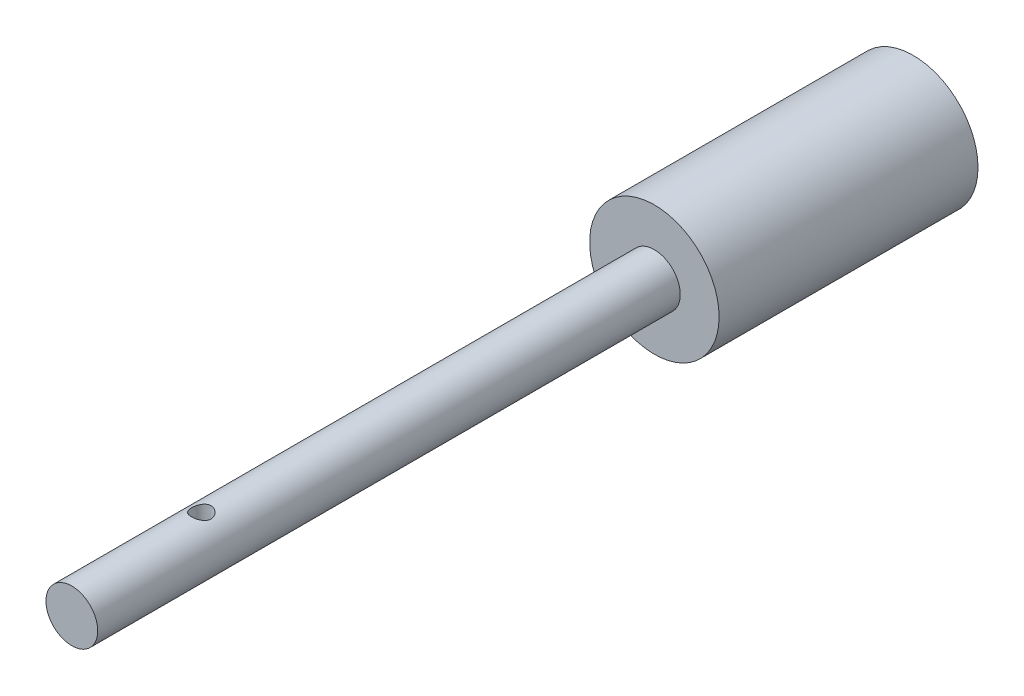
ISO-10303-21;
HEADER;
FILE_DESCRIPTION(('STEP AP214'),'2;1');
FILE_NAME('part.step','',(''),(''),'','','');
FILE_SCHEMA(('AUTOMOTIVE_DESIGN { 1 0 10303 214 1 1 1 1 }'));
ENDSEC;
DATA;
#1=APPLICATION_CONTEXT('core data for automotive mechanical design processes');
#2=APPLICATION_PROTOCOL_DEFINITION('international standard','automotive_design',2000,#1);
#3=PRODUCT_CONTEXT('',#1,'mechanical');
#4=PRODUCT('Part','Part','',(#3));
#5=PRODUCT_RELATED_PRODUCT_CATEGORY('part','',(#4));
#6=PRODUCT_DEFINITION_FORMATION('','',#4);
#7=PRODUCT_DEFINITION_CONTEXT('part definition',#1,'design');
#8=PRODUCT_DEFINITION('design','',#6,#7);
#9=PRODUCT_DEFINITION_SHAPE('','',#8);
#10=(LENGTH_UNIT() NAMED_UNIT(*) SI_UNIT(.MILLI.,.METRE.));
#11=(NAMED_UNIT(*) PLANE_ANGLE_UNIT() SI_UNIT($,.RADIAN.));
#12=(NAMED_UNIT(*) SI_UNIT($,.STERADIAN.) SOLID_ANGLE_UNIT());
#13=UNCERTAINTY_MEASURE_WITH_UNIT(LENGTH_MEASURE(1.E-05),#10,'distance_accuracy_value','');
#14=(GEOMETRIC_REPRESENTATION_CONTEXT(3) GLOBAL_UNCERTAINTY_ASSIGNED_CONTEXT((#13)) GLOBAL_UNIT_ASSIGNED_CONTEXT((#10,
#11,#12)) REPRESENTATION_CONTEXT('',''));
#15=CARTESIAN_POINT('',(0.,0.,0.));
#16=DIRECTION('',(0.,0.,1.));
#17=DIRECTION('',(1.,0.,0.));
#18=AXIS2_PLACEMENT_3D('',#15,#16,#17);
#19=CARTESIAN_POINT('',(0.,0.,114.3));
#20=DIRECTION('',(0.,0.,-1.));
#21=DIRECTION('',(-1.,0.,0.));
#22=AXIS2_PLACEMENT_3D('',#19,#20,#21);
#23=CYLINDRICAL_SURFACE('',#22,5.08);
#24=CARTESIAN_POINT('',(0.,-5.08,90.805));
#25=CARTESIAN_POINT('',(0.103168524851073,-5.08000276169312,90.805003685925));
#26=CARTESIAN_POINT('',(0.206311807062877,-5.07682981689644,90.7965929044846));
#27=CARTESIAN_POINT('',(0.409515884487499,-5.06448943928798,90.7633081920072));
#28=CARTESIAN_POINT('',(0.509577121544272,-5.05532286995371,90.7384366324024));
#29=CARTESIAN_POINT('',(0.703657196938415,-5.03197917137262,90.6732336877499));
#30=CARTESIAN_POINT('',(0.797687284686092,-5.01781171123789,90.6329321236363));
#31=CARTESIAN_POINT('',(0.977645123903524,-4.98587735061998,90.5381648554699));
#32=CARTESIAN_POINT('',(1.06357069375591,-4.96810948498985,90.4836953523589));
#33=CARTESIAN_POINT('',(1.2285299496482,-4.92996533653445,90.35972208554));
#34=CARTESIAN_POINT('',(1.30717382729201,-4.90951523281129,90.2897225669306));
#35=CARTESIAN_POINT('',(1.45192015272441,-4.86867480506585,90.1377287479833));
#36=CARTESIAN_POINT('',(1.51801876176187,-4.84828450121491,90.0557307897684));
#37=CARTESIAN_POINT('',(1.63827716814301,-4.80901337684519,89.8782588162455));
#38=CARTESIAN_POINT('',(1.69188629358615,-4.79021964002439,89.7823904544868));
#39=CARTESIAN_POINT('',(1.78204680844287,-4.7574182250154,89.582182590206));
#40=CARTESIAN_POINT('',(1.81860501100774,-4.74340863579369,89.477846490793));
#41=CARTESIAN_POINT('',(1.87208707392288,-4.72255104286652,89.2681517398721));
#42=CARTESIAN_POINT('',(1.88975483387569,-4.71543283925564,89.163010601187));
#43=CARTESIAN_POINT('',(1.90728036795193,-4.70837338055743,88.9510334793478));
#44=CARTESIAN_POINT('',(1.90714549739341,-4.70842916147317,88.8441982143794));
#45=CARTESIAN_POINT('',(1.88963845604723,-4.71547839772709,88.6386727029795));
#46=CARTESIAN_POINT('',(1.87329836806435,-4.72205645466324,88.5398776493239));
#47=CARTESIAN_POINT('',(1.82555093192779,-4.74071871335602,88.3465503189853));
#48=CARTESIAN_POINT('',(1.79414131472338,-4.75280374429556,88.2520186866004));
#49=CARTESIAN_POINT('',(1.71657960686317,-4.78136841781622,88.0677981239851));
#50=CARTESIAN_POINT('',(1.67015983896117,-4.79792687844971,87.9782346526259));
#51=CARTESIAN_POINT('',(1.56408213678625,-4.83354646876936,87.8078689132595));
#52=CARTESIAN_POINT('',(1.50441963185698,-4.8526084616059,87.72706968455));
#53=CARTESIAN_POINT('',(1.36882861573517,-4.89265009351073,87.5708133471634));
#54=CARTESIAN_POINT('',(1.29207639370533,-4.91367251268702,87.4960802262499));
#55=CARTESIAN_POINT('',(1.12688699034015,-4.95416494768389,87.3603307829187));
#56=CARTESIAN_POINT('',(1.03844801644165,-4.97363472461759,87.2993165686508));
#57=CARTESIAN_POINT('',(0.850548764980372,-5.00921521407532,87.1919383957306));
#58=CARTESIAN_POINT('',(0.750939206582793,-5.02526932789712,87.1458155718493));
#59=CARTESIAN_POINT('',(0.544622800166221,-5.05178972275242,87.0712220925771));
#60=CARTESIAN_POINT('',(0.437919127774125,-5.06225848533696,87.0427435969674));
#61=CARTESIAN_POINT('',(0.226536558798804,-5.07599242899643,87.0056390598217));
#62=CARTESIAN_POINT('',(0.122051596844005,-5.07961098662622,86.9960380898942));
#63=CARTESIAN_POINT('',(-0.0870870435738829,-5.0803288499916,86.9941223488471));
#64=CARTESIAN_POINT('',(-0.191740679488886,-5.07742960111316,87.0018037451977));
#65=CARTESIAN_POINT('',(-0.394032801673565,-5.06567071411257,87.033493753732));
#66=CARTESIAN_POINT('',(-0.49178632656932,-5.05704438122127,87.0568636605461));
#67=CARTESIAN_POINT('',(-0.681916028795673,-5.03493375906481,87.1184263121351));
#68=CARTESIAN_POINT('',(-0.77429150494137,-5.02144883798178,87.156620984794));
#69=CARTESIAN_POINT('',(-0.9540846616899,-4.99046022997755,87.2479667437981));
#70=CARTESIAN_POINT('',(-1.04127691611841,-4.97285010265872,87.3015243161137));
#71=CARTESIAN_POINT('',(-1.20572874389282,-4.93555872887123,87.4216159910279));
#72=CARTESIAN_POINT('',(-1.28298463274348,-4.91587671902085,87.4881548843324));
#73=CARTESIAN_POINT('',(-1.43005911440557,-4.87519128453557,87.6368632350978));
#74=CARTESIAN_POINT('',(-1.49918615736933,-4.85417744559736,87.7197155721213));
#75=CARTESIAN_POINT('',(-1.62269233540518,-4.81430095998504,87.8962572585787));
#76=CARTESIAN_POINT('',(-1.67707014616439,-4.79543850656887,87.9899475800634));
#77=CARTESIAN_POINT('',(-1.76958972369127,-4.76207873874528,88.1862803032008));
#78=CARTESIAN_POINT('',(-1.80766320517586,-4.74759985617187,88.2889582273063));
#79=CARTESIAN_POINT('',(-1.86573012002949,-4.72508621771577,88.4999623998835));
#80=CARTESIAN_POINT('',(-1.8857347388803,-4.71704747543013,88.6082851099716));
#81=CARTESIAN_POINT('',(-1.90609660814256,-4.70885386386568,88.8200105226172));
#82=CARTESIAN_POINT('',(-1.90763310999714,-4.70822584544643,88.9232824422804));
#83=CARTESIAN_POINT('',(-1.89403628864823,-4.71371184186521,89.1285305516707));
#84=CARTESIAN_POINT('',(-1.87890454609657,-4.71982521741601,89.2305068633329));
#85=CARTESIAN_POINT('',(-1.83331885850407,-4.73771139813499,89.42710997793));
#86=CARTESIAN_POINT('',(-1.80334663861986,-4.74930578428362,89.5218660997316));
#87=CARTESIAN_POINT('',(-1.72935514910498,-4.77674366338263,89.7050599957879));
#88=CARTESIAN_POINT('',(-1.6853323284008,-4.79258823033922,89.7934961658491));
#89=CARTESIAN_POINT('',(-1.58181136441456,-4.82777449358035,89.966580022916));
#90=CARTESIAN_POINT('',(-1.52162297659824,-4.84725597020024,90.0507861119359));
#91=CARTESIAN_POINT('',(-1.38854796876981,-4.88703933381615,90.2082797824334));
#92=CARTESIAN_POINT('',(-1.31565731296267,-4.90734147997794,90.2815638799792));
#93=CARTESIAN_POINT('',(-1.15453210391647,-4.94779839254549,90.4191764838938));
#94=CARTESIAN_POINT('',(-1.0656806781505,-4.96788573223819,90.482805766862));
#95=CARTESIAN_POINT('',(-0.877840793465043,-5.00449233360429,90.5942087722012));
#96=CARTESIAN_POINT('',(-0.778851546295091,-5.0210113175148,90.6419812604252));
#97=CARTESIAN_POINT('',(-0.568958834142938,-5.04919351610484,90.7216585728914));
#98=CARTESIAN_POINT('',(-0.457725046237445,-5.06061544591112,90.7527865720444));
#99=CARTESIAN_POINT('',(-0.230982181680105,-5.07601527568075,90.7944500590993));
#100=CARTESIAN_POINT('',(-0.115475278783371,-5.07999690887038,90.8049958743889));
#101=CARTESIAN_POINT('',(0.,-5.08,90.805));
#102=B_SPLINE_CURVE_WITH_KNOTS('',3,(#24,#25,#26,#27,#28,#29,#30,#31,#32,#33,#34,#35,#36,#37,
#38,#39,#40,#41,#42,#43,#44,#45,#46,#47,#48,#49,#50,#51,#52,#53,#54,#55,#56,#57,#58,#59,#60,#61,
#62,#63,#64,#65,#66,#67,#68,#69,#70,#71,#72,#73,#74,#75,#76,#77,#78,#79,#80,#81,#82,#83,#84,#85,
#86,#87,#88,#89,#90,#91,#92,#93,#94,#95,#96,#97,#98,#99,#100,#101),.UNSPECIFIED.,.T.,.F.,(4,2,2,
2,2,2,2,2,2,2,2,2,2,2,2,2,2,2,2,2,2,2,2,2,2,2,2,2,2,2,2,2,2,2,2,2,2,2,4),(0.,0.30907964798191,
0.618114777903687,0.926555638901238,1.23507929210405,1.55541495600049,1.8758484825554,
2.20848776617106,2.5409940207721,2.85986060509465,3.17859544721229,3.47825498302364,
3.7779596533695,4.08333458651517,4.38881508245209,4.71482614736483,5.04088727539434,
5.37199046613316,5.70294642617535,6.01630774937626,6.32959958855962,6.63085336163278,
6.93214632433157,7.24229211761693,7.55255258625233,7.88081379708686,8.2091044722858,
8.5387569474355,8.86820521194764,9.1764962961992,9.48475814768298,9.78361190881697,
10.0825412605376,10.3971403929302,10.7118396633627,11.0435685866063,11.3753233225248,
11.7214461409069,12.0673952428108),.UNSPECIFIED.);
#103=CARTESIAN_POINT('',(0.,-5.08,90.805));
#104=VERTEX_POINT('',#103);
#105=EDGE_CURVE('E45',#104,#104,#102,.T.);
#106=ORIENTED_EDGE('',*,*,#105,.T.);
#107=EDGE_LOOP('',(#106));
#108=FACE_BOUND('',#107,.T.);
#109=CARTESIAN_POINT('',(0.,5.08,90.805));
#110=CARTESIAN_POINT('',(-0.103168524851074,5.08000276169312,90.805003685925));
#111=CARTESIAN_POINT('',(-0.206311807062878,5.07682981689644,90.7965929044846));
#112=CARTESIAN_POINT('',(-0.4095158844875,5.06448943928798,90.7633081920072));
#113=CARTESIAN_POINT('',(-0.509577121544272,5.05532286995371,90.7384366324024));
#114=CARTESIAN_POINT('',(-0.703657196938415,5.03197917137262,90.6732336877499));
#115=CARTESIAN_POINT('',(-0.797687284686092,5.01781171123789,90.6329321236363));
#116=CARTESIAN_POINT('',(-0.977645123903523,4.98587735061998,90.5381648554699));
#117=CARTESIAN_POINT('',(-1.06357069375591,4.96810948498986,90.4836953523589));
#118=CARTESIAN_POINT('',(-1.2285299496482,4.92996533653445,90.35972208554));
#119=CARTESIAN_POINT('',(-1.30717382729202,4.90951523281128,90.2897225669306));
#120=CARTESIAN_POINT('',(-1.45192015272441,4.86867480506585,90.1377287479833));
#121=CARTESIAN_POINT('',(-1.51801876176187,4.84828450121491,90.0557307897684));
#122=CARTESIAN_POINT('',(-1.63827716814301,4.80901337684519,89.8782588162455));
#123=CARTESIAN_POINT('',(-1.69188629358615,4.79021964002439,89.7823904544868));
#124=CARTESIAN_POINT('',(-1.78204680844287,4.7574182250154,89.582182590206));
#125=CARTESIAN_POINT('',(-1.81860501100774,4.74340863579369,89.477846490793));
#126=CARTESIAN_POINT('',(-1.87208707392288,4.72255104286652,89.2681517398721));
#127=CARTESIAN_POINT('',(-1.88975483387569,4.71543283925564,89.163010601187));
#128=CARTESIAN_POINT('',(-1.90728036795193,4.70837338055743,88.9510334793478));
#129=CARTESIAN_POINT('',(-1.90714549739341,4.70842916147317,88.8441982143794));
#130=CARTESIAN_POINT('',(-1.88963845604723,4.71547839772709,88.6386727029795));
#131=CARTESIAN_POINT('',(-1.87329836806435,4.72205645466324,88.5398776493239));
#132=CARTESIAN_POINT('',(-1.82555093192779,4.74071871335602,88.3465503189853));
#133=CARTESIAN_POINT('',(-1.79414131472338,4.75280374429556,88.2520186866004));
#134=CARTESIAN_POINT('',(-1.71657960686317,4.78136841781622,88.0677981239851));
#135=CARTESIAN_POINT('',(-1.67015983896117,4.79792687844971,87.9782346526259));
#136=CARTESIAN_POINT('',(-1.56408213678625,4.83354646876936,87.8078689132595));
#137=CARTESIAN_POINT('',(-1.50441963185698,4.8526084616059,87.72706968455));
#138=CARTESIAN_POINT('',(-1.36882861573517,4.89265009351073,87.5708133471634));
#139=CARTESIAN_POINT('',(-1.29207639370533,4.91367251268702,87.4960802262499));
#140=CARTESIAN_POINT('',(-1.12688699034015,4.95416494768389,87.3603307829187));
#141=CARTESIAN_POINT('',(-1.03844801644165,4.97363472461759,87.2993165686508));
#142=CARTESIAN_POINT('',(-0.850548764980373,5.00921521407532,87.1919383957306));
#143=CARTESIAN_POINT('',(-0.750939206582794,5.02526932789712,87.1458155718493));
#144=CARTESIAN_POINT('',(-0.544622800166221,5.05178972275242,87.0712220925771));
#145=CARTESIAN_POINT('',(-0.437919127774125,5.06225848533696,87.0427435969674));
#146=CARTESIAN_POINT('',(-0.226536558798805,5.07599242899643,87.0056390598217));
#147=CARTESIAN_POINT('',(-0.122051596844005,5.07961098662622,86.9960380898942));
#148=CARTESIAN_POINT('',(0.0870870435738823,5.0803288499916,86.9941223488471));
#149=CARTESIAN_POINT('',(0.191740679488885,5.07742960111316,87.0018037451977));
#150=CARTESIAN_POINT('',(0.394032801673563,5.06567071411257,87.033493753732));
#151=CARTESIAN_POINT('',(0.491786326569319,5.05704438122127,87.0568636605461));
#152=CARTESIAN_POINT('',(0.681916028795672,5.03493375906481,87.1184263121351));
#153=CARTESIAN_POINT('',(0.77429150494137,5.02144883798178,87.156620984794));
#154=CARTESIAN_POINT('',(0.954084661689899,4.99046022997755,87.2479667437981));
#155=CARTESIAN_POINT('',(1.0412769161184,4.97285010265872,87.3015243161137));
#156=CARTESIAN_POINT('',(1.20572874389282,4.93555872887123,87.4216159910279));
#157=CARTESIAN_POINT('',(1.28298463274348,4.91587671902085,87.4881548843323));
#158=CARTESIAN_POINT('',(1.43005911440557,4.87519128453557,87.6368632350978));
#159=CARTESIAN_POINT('',(1.49918615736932,4.85417744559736,87.7197155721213));
#160=CARTESIAN_POINT('',(1.62269233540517,4.81430095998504,87.8962572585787));
#161=CARTESIAN_POINT('',(1.67707014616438,4.79543850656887,87.9899475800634));
#162=CARTESIAN_POINT('',(1.76958972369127,4.76207873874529,88.1862803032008));
#163=CARTESIAN_POINT('',(1.80766320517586,4.74759985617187,88.2889582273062));
#164=CARTESIAN_POINT('',(1.86573012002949,4.72508621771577,88.4999623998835));
#165=CARTESIAN_POINT('',(1.8857347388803,4.71704747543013,88.6082851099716));
#166=CARTESIAN_POINT('',(1.90609660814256,4.70885386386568,88.8200105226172));
#167=CARTESIAN_POINT('',(1.90763310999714,4.70822584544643,88.9232824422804));
#168=CARTESIAN_POINT('',(1.89403628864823,4.71371184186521,89.1285305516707));
#169=CARTESIAN_POINT('',(1.87890454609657,4.71982521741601,89.2305068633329));
#170=CARTESIAN_POINT('',(1.83331885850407,4.73771139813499,89.42710997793));
#171=CARTESIAN_POINT('',(1.80334663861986,4.74930578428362,89.5218660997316));
#172=CARTESIAN_POINT('',(1.72935514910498,4.77674366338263,89.7050599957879));
#173=CARTESIAN_POINT('',(1.6853323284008,4.79258823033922,89.7934961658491));
#174=CARTESIAN_POINT('',(1.58181136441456,4.82777449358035,89.966580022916));
#175=CARTESIAN_POINT('',(1.52162297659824,4.84725597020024,90.0507861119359));
#176=CARTESIAN_POINT('',(1.38854796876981,4.88703933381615,90.2082797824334));
#177=CARTESIAN_POINT('',(1.31565731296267,4.90734147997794,90.2815638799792));
#178=CARTESIAN_POINT('',(1.15453210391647,4.94779839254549,90.4191764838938));
#179=CARTESIAN_POINT('',(1.0656806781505,4.96788573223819,90.482805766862));
#180=CARTESIAN_POINT('',(0.877840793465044,5.00449233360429,90.5942087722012));
#181=CARTESIAN_POINT('',(0.778851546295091,5.0210113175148,90.6419812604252));
#182=CARTESIAN_POINT('',(0.568958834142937,5.04919351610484,90.7216585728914));
#183=CARTESIAN_POINT('',(0.457725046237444,5.06061544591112,90.7527865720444));
#184=CARTESIAN_POINT('',(0.230982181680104,5.07601527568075,90.7944500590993));
#185=CARTESIAN_POINT('',(0.115475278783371,5.07999690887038,90.8049958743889));
#186=CARTESIAN_POINT('',(0.,5.08,90.805));
#187=B_SPLINE_CURVE_WITH_KNOTS('',3,(#109,#110,#111,#112,#113,#114,#115,#116,#117,#118,#119,
#120,#121,#122,#123,#124,#125,#126,#127,#128,#129,#130,#131,#132,#133,#134,#135,#136,#137,#138,
#139,#140,#141,#142,#143,#144,#145,#146,#147,#148,#149,#150,#151,#152,#153,#154,#155,#156,#157,
#158,#159,#160,#161,#162,#163,#164,#165,#166,#167,#168,#169,#170,#171,#172,#173,#174,#175,#176,
#177,#178,#179,#180,#181,#182,#183,#184,#185,#186),.UNSPECIFIED.,.T.,.F.,(4,2,2,2,2,2,2,2,2,2,2,
2,2,2,2,2,2,2,2,2,2,2,2,2,2,2,2,2,2,2,2,2,2,2,2,2,2,2,4),(0.,0.309079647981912,
0.618114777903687,0.926555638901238,1.23507929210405,1.55541495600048,1.8758484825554,
2.20848776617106,2.5409940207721,2.85986060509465,3.17859544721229,3.47825498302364,
3.77795965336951,4.08333458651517,4.38881508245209,4.71482614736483,5.04088727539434,
5.37199046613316,5.70294642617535,6.01630774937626,6.32959958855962,6.63085336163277,
6.93214632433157,7.24229211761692,7.55255258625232,7.88081379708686,8.20910447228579,
8.53875694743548,8.86820521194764,9.1764962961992,9.48475814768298,9.78361190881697,
10.0825412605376,10.3971403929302,10.7118396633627,11.0435685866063,11.3753233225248,
11.7214461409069,12.0673952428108),.UNSPECIFIED.);
#188=CARTESIAN_POINT('',(0.,5.08,90.805));
#189=VERTEX_POINT('',#188);
#190=EDGE_CURVE('E63',#189,#189,#187,.T.);
#191=ORIENTED_EDGE('',*,*,#190,.T.);
#192=EDGE_LOOP('',(#191));
#193=FACE_BOUND('',#192,.T.);
#194=CARTESIAN_POINT('',(0.,0.,114.3));
#195=DIRECTION('',(0.,0.,1.));
#196=DIRECTION('',(1.,0.,0.));
#197=AXIS2_PLACEMENT_3D('',#194,#195,#196);
#198=CIRCLE('',#197,5.08);
#199=CARTESIAN_POINT('',(5.08,0.,114.3));
#200=VERTEX_POINT('',#199);
#201=EDGE_CURVE('E10',#200,#200,#198,.T.);
#202=ORIENTED_EDGE('',*,*,#201,.F.);
#203=EDGE_LOOP('',(#202));
#204=FACE_BOUND('',#203,.T.);
#205=CARTESIAN_POINT('',(0.,0.,0.));
#206=DIRECTION('',(0.,0.,1.));
#207=DIRECTION('',(1.,0.,0.));
#208=AXIS2_PLACEMENT_3D('',#205,#206,#207);
#209=CIRCLE('',#208,5.08);
#210=CARTESIAN_POINT('',(5.08,0.,0.));
#211=VERTEX_POINT('',#210);
#212=EDGE_CURVE('E53',#211,#211,#209,.T.);
#213=ORIENTED_EDGE('',*,*,#212,.T.);
#214=EDGE_LOOP('',(#213));
#215=FACE_BOUND('',#214,.T.);
#216=ADVANCED_FACE('F41',(#108,#193,#204,#215),#23,.T.);
#217=CARTESIAN_POINT('',(0.,0.,114.3));
#218=DIRECTION('',(0.,0.,1.));
#219=DIRECTION('',(1.,0.,0.));
#220=AXIS2_PLACEMENT_3D('',#217,#218,#219);
#221=PLANE('',#220);
#222=ORIENTED_EDGE('',*,*,#201,.T.);
#223=EDGE_LOOP('',(#222));
#224=FACE_BOUND('',#223,.T.);
#225=ADVANCED_FACE('F84',(#224),#221,.T.);
#226=CARTESIAN_POINT('',(0.,0.,-50.8));
#227=DIRECTION('',(0.,0.,1.));
#228=DIRECTION('',(1.,0.,0.));
#229=AXIS2_PLACEMENT_3D('',#226,#227,#228);
#230=CYLINDRICAL_SURFACE('',#229,12.7);
#231=CARTESIAN_POINT('',(0.,0.,-50.8));
#232=DIRECTION('',(0.,0.,1.));
#233=DIRECTION('',(1.,0.,0.));
#234=AXIS2_PLACEMENT_3D('',#231,#232,#233);
#235=CIRCLE('',#234,12.7);
#236=CARTESIAN_POINT('',(12.7,0.,-50.8));
#237=VERTEX_POINT('',#236);
#238=EDGE_CURVE('E58',#237,#237,#235,.T.);
#239=ORIENTED_EDGE('',*,*,#238,.T.);
#240=EDGE_LOOP('',(#239));
#241=FACE_BOUND('',#240,.T.);
#242=CARTESIAN_POINT('',(0.,0.,0.));
#243=DIRECTION('',(0.,0.,1.));
#244=DIRECTION('',(1.,0.,0.));
#245=AXIS2_PLACEMENT_3D('',#242,#243,#244);
#246=CIRCLE('',#245,12.7);
#247=CARTESIAN_POINT('',(12.7,0.,0.));
#248=VERTEX_POINT('',#247);
#249=EDGE_CURVE('E61',#248,#248,#246,.T.);
#250=ORIENTED_EDGE('',*,*,#249,.F.);
#251=EDGE_LOOP('',(#250));
#252=FACE_BOUND('',#251,.T.);
#253=ADVANCED_FACE('F78',(#241,#252),#230,.T.);
#254=CARTESIAN_POINT('',(0.,0.,-50.8));
#255=DIRECTION('',(0.,0.,1.));
#256=DIRECTION('',(1.,0.,0.));
#257=AXIS2_PLACEMENT_3D('',#254,#255,#256);
#258=PLANE('',#257);
#259=ORIENTED_EDGE('',*,*,#238,.F.);
#260=EDGE_LOOP('',(#259));
#261=FACE_BOUND('',#260,.T.);
#262=ADVANCED_FACE('F74',(#261),#258,.F.);
#263=CARTESIAN_POINT('',(0.,0.,0.));
#264=DIRECTION('',(0.,0.,1.));
#265=DIRECTION('',(1.,0.,0.));
#266=AXIS2_PLACEMENT_3D('',#263,#264,#265);
#267=PLANE('',#266);
#268=ORIENTED_EDGE('',*,*,#212,.F.);
#269=EDGE_LOOP('',(#268));
#270=FACE_BOUND('',#269,.T.);
#271=ORIENTED_EDGE('',*,*,#249,.T.);
#272=EDGE_LOOP('',(#271));
#273=FACE_BOUND('',#272,.T.);
#274=ADVANCED_FACE('F72',(#270,#273),#267,.T.);
#275=CARTESIAN_POINT('',(0.,-12.7,88.9));
#276=DIRECTION('',(0.,1.,0.));
#277=DIRECTION('',(0.,0.,1.));
#278=AXIS2_PLACEMENT_3D('',#275,#276,#277);
#279=CYLINDRICAL_SURFACE('',#278,1.905);
#280=ORIENTED_EDGE('',*,*,#190,.F.);
#281=EDGE_LOOP('',(#280));
#282=FACE_BOUND('',#281,.T.);
#283=ORIENTED_EDGE('',*,*,#105,.F.);
#284=EDGE_LOOP('',(#283));
#285=FACE_BOUND('',#284,.T.);
#286=ADVANCED_FACE('F68',(#282,#285),#279,.F.);
#287=CLOSED_SHELL('',(#216,#225,#253,#262,#274,#286));
#288=MANIFOLD_SOLID_BREP('B2',#287);
#289=ADVANCED_BREP_SHAPE_REPRESENTATION('',(#18,#288),#14);
#290=SHAPE_DEFINITION_REPRESENTATION(#9,#289);
ENDSEC;
END-ISO-10303-21;
